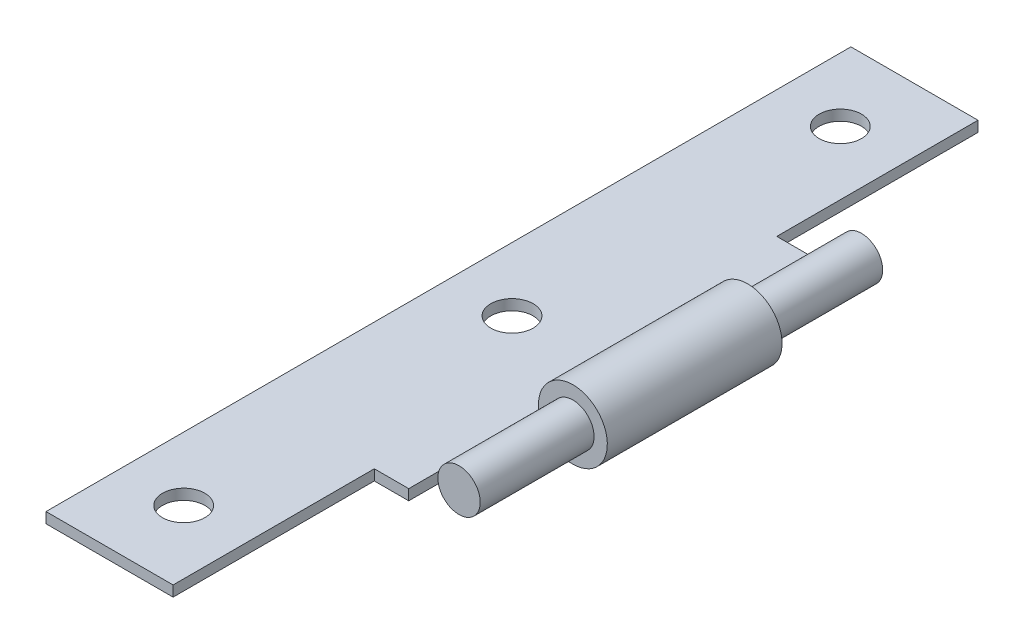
ISO-10303-21;
HEADER;
FILE_DESCRIPTION(('STEP AP214'),'2;1');
FILE_NAME('part.step','',(''),(''),'','','');
FILE_SCHEMA(('AUTOMOTIVE_DESIGN { 1 0 10303 214 1 1 1 1 }'));
ENDSEC;
DATA;
#1=APPLICATION_CONTEXT('core data for automotive mechanical design processes');
#2=APPLICATION_PROTOCOL_DEFINITION('international standard','automotive_design',2000,#1);
#3=PRODUCT_CONTEXT('',#1,'mechanical');
#4=PRODUCT('Part','Part','',(#3));
#5=PRODUCT_RELATED_PRODUCT_CATEGORY('part','',(#4));
#6=PRODUCT_DEFINITION_FORMATION('','',#4);
#7=PRODUCT_DEFINITION_CONTEXT('part definition',#1,'design');
#8=PRODUCT_DEFINITION('design','',#6,#7);
#9=PRODUCT_DEFINITION_SHAPE('','',#8);
#10=(LENGTH_UNIT() NAMED_UNIT(*) SI_UNIT(.MILLI.,.METRE.));
#11=(NAMED_UNIT(*) PLANE_ANGLE_UNIT() SI_UNIT($,.RADIAN.));
#12=(NAMED_UNIT(*) SI_UNIT($,.STERADIAN.) SOLID_ANGLE_UNIT());
#13=UNCERTAINTY_MEASURE_WITH_UNIT(LENGTH_MEASURE(1.E-05),#10,'distance_accuracy_value','');
#14=(GEOMETRIC_REPRESENTATION_CONTEXT(3) GLOBAL_UNCERTAINTY_ASSIGNED_CONTEXT((#13)) GLOBAL_UNIT_ASSIGNED_CONTEXT((#10,
#11,#12)) REPRESENTATION_CONTEXT('',''));
#15=CARTESIAN_POINT('',(0.,0.,0.));
#16=DIRECTION('',(0.,0.,1.));
#17=DIRECTION('',(1.,0.,0.));
#18=AXIS2_PLACEMENT_3D('',#15,#16,#17);
#19=CARTESIAN_POINT('',(-20.,-2.25,58.0249843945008));
#20=DIRECTION('',(0.,-1.,0.));
#21=DIRECTION('',(0.,0.,-1.));
#22=AXIS2_PLACEMENT_3D('',#19,#20,#21);
#23=PLANE('',#22);
#24=CARTESIAN_POINT('',(-14.,-2.25,0.));
#25=DIRECTION('',(0.,1.,0.));
#26=DIRECTION('',(0.,0.,1.));
#27=AXIS2_PLACEMENT_3D('',#24,#25,#26);
#28=CIRCLE('',#27,2.);
#29=CARTESIAN_POINT('',(-14.,-2.25,2.));
#30=VERTEX_POINT('',#29);
#31=EDGE_CURVE('E463',#30,#30,#28,.T.);
#32=ORIENTED_EDGE('',*,*,#31,.F.);
#33=EDGE_LOOP('',(#32));
#34=FACE_BOUND('',#33,.T.);
#35=DIRECTION('',(0.,0.,-1.));
#36=VECTOR('',#35,1.);
#37=CARTESIAN_POINT('',(-4.75000000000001,-2.25,58.0249843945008));
#38=LINE('',#37,#36);
#39=CARTESIAN_POINT('',(-4.75,-2.25,19.));
#40=VERTEX_POINT('',#39);
#41=CARTESIAN_POINT('',(-4.75,-2.25,8.25));
#42=VERTEX_POINT('',#41);
#43=EDGE_CURVE('E159',#40,#42,#38,.T.);
#44=ORIENTED_EDGE('',*,*,#43,.T.);
#45=DIRECTION('',(1.,0.,0.));
#46=VECTOR('',#45,1.);
#47=CARTESIAN_POINT('',(-20.,-2.25,8.25));
#48=LINE('',#47,#46);
#49=CARTESIAN_POINT('',(-2.34520787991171,-2.25,8.25));
#50=VERTEX_POINT('',#49);
#51=EDGE_CURVE('E162',#42,#50,#48,.T.);
#52=ORIENTED_EDGE('',*,*,#51,.T.);
#53=DIRECTION('',(0.,0.,-1.));
#54=VECTOR('',#53,1.);
#55=CARTESIAN_POINT('',(-2.34520787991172,-2.25,38.));
#56=LINE('',#55,#54);
#57=CARTESIAN_POINT('',(-2.34520787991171,-2.25,-8.25));
#58=VERTEX_POINT('',#57);
#59=EDGE_CURVE('E209',#50,#58,#56,.T.);
#60=ORIENTED_EDGE('',*,*,#59,.T.);
#61=DIRECTION('',(-1.,0.,0.));
#62=VECTOR('',#61,1.);
#63=CARTESIAN_POINT('',(-20.,-2.25,-8.25));
#64=LINE('',#63,#62);
#65=CARTESIAN_POINT('',(-4.75,-2.25,-8.25));
#66=VERTEX_POINT('',#65);
#67=EDGE_CURVE('E178',#58,#66,#64,.T.);
#68=ORIENTED_EDGE('',*,*,#67,.T.);
#69=DIRECTION('',(0.,0.,-1.));
#70=VECTOR('',#69,1.);
#71=CARTESIAN_POINT('',(-4.74999999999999,-2.25,58.0249843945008));
#72=LINE('',#71,#70);
#73=CARTESIAN_POINT('',(-4.75,-2.25,-19.));
#74=VERTEX_POINT('',#73);
#75=EDGE_CURVE('E189',#66,#74,#72,.T.);
#76=ORIENTED_EDGE('',*,*,#75,.T.);
#77=DIRECTION('',(-1.,0.,0.));
#78=VECTOR('',#77,1.);
#79=CARTESIAN_POINT('',(-20.,-2.25,-19.));
#80=LINE('',#79,#78);
#81=CARTESIAN_POINT('',(-8.,-2.25,-19.));
#82=VERTEX_POINT('',#81);
#83=EDGE_CURVE('E192',#74,#82,#80,.T.);
#84=ORIENTED_EDGE('',*,*,#83,.T.);
#85=DIRECTION('',(0.,0.,-1.));
#86=VECTOR('',#85,1.);
#87=CARTESIAN_POINT('',(-8.,-2.25,58.0249843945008));
#88=LINE('',#87,#86);
#89=CARTESIAN_POINT('',(-8.,-2.25,-38.));
#90=VERTEX_POINT('',#89);
#91=EDGE_CURVE('E195',#82,#90,#88,.T.);
#92=ORIENTED_EDGE('',*,*,#91,.T.);
#93=DIRECTION('',(1.,0.,0.));
#94=VECTOR('',#93,1.);
#95=CARTESIAN_POINT('',(-20.,-2.25,-38.));
#96=LINE('',#95,#94);
#97=CARTESIAN_POINT('',(-20.,-2.25,-38.));
#98=VERTEX_POINT('',#97);
#99=EDGE_CURVE('E198',#98,#90,#96,.T.);
#100=ORIENTED_EDGE('',*,*,#99,.F.);
#101=DIRECTION('',(0.,0.,-1.));
#102=VECTOR('',#101,1.);
#103=CARTESIAN_POINT('',(-20.,-2.25,58.0249843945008));
#104=LINE('',#103,#102);
#105=CARTESIAN_POINT('',(-20.,-2.25,38.));
#106=VERTEX_POINT('',#105);
#107=EDGE_CURVE('E206',#106,#98,#104,.T.);
#108=ORIENTED_EDGE('',*,*,#107,.F.);
#109=DIRECTION('',(-1.,0.,0.));
#110=VECTOR('',#109,1.);
#111=CARTESIAN_POINT('',(-20.,-2.25,38.));
#112=LINE('',#111,#110);
#113=CARTESIAN_POINT('',(-8.,-2.25,38.));
#114=VERTEX_POINT('',#113);
#115=EDGE_CURVE('E213',#114,#106,#112,.T.);
#116=ORIENTED_EDGE('',*,*,#115,.F.);
#117=DIRECTION('',(0.,0.,-1.));
#118=VECTOR('',#117,1.);
#119=CARTESIAN_POINT('',(-8.,-2.25,58.0249843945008));
#120=LINE('',#119,#118);
#121=CARTESIAN_POINT('',(-8.,-2.25,19.));
#122=VERTEX_POINT('',#121);
#123=EDGE_CURVE('E154',#114,#122,#120,.T.);
#124=ORIENTED_EDGE('',*,*,#123,.T.);
#125=DIRECTION('',(1.,0.,0.));
#126=VECTOR('',#125,1.);
#127=CARTESIAN_POINT('',(-20.,-2.25,19.));
#128=LINE('',#127,#126);
#129=EDGE_CURVE('E131',#122,#40,#128,.T.);
#130=ORIENTED_EDGE('',*,*,#129,.T.);
#131=EDGE_LOOP('',(#44,#52,#60,#68,#76,#84,#92,#100,#108,#116,#124,#130));
#132=FACE_BOUND('',#131,.T.);
#133=CARTESIAN_POINT('',(-14.,-2.25,31.));
#134=DIRECTION('',(0.,1.,0.));
#135=DIRECTION('',(0.,0.,1.));
#136=AXIS2_PLACEMENT_3D('',#133,#134,#135);
#137=CIRCLE('',#136,2.);
#138=CARTESIAN_POINT('',(-14.,-2.25,33.));
#139=VERTEX_POINT('',#138);
#140=EDGE_CURVE('E471',#139,#139,#137,.T.);
#141=ORIENTED_EDGE('',*,*,#140,.F.);
#142=EDGE_LOOP('',(#141));
#143=FACE_BOUND('',#142,.T.);
#144=CARTESIAN_POINT('',(-14.,-2.25,-31.));
#145=DIRECTION('',(0.,1.,0.));
#146=DIRECTION('',(0.,0.,1.));
#147=AXIS2_PLACEMENT_3D('',#144,#145,#146);
#148=CIRCLE('',#147,2.);
#149=CARTESIAN_POINT('',(-14.,-2.25,-29.));
#150=VERTEX_POINT('',#149);
#151=EDGE_CURVE('E460',#150,#150,#148,.T.);
#152=ORIENTED_EDGE('',*,*,#151,.F.);
#153=EDGE_LOOP('',(#152));
#154=FACE_BOUND('',#153,.T.);
#155=ADVANCED_FACE('F33',(#34,#132,#143,#154),#23,.F.);
#156=CARTESIAN_POINT('',(0.,0.,38.));
#157=DIRECTION('',(0.,0.,-1.));
#158=DIRECTION('',(-1.,0.,0.));
#159=AXIS2_PLACEMENT_3D('',#156,#157,#158);
#160=CYLINDRICAL_SURFACE('',#159,3.25);
#161=ORIENTED_EDGE('',*,*,#59,.F.);
#162=CARTESIAN_POINT('',(0.,0.,8.25));
#163=DIRECTION('',(0.,0.,-1.));
#164=DIRECTION('',(-1.,0.,0.));
#165=AXIS2_PLACEMENT_3D('',#162,#163,#164);
#166=CIRCLE('',#165,3.25);
#167=CARTESIAN_POINT('',(0.,-3.25,8.25));
#168=VERTEX_POINT('',#167);
#169=EDGE_CURVE('E165',#50,#168,#166,.T.);
#170=ORIENTED_EDGE('',*,*,#169,.T.);
#171=DIRECTION('',(0.,0.,-1.));
#172=VECTOR('',#171,1.);
#173=CARTESIAN_POINT('',(0.,-3.25,58.0249843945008));
#174=LINE('',#173,#172);
#175=CARTESIAN_POINT('',(0.,-3.25,-8.25));
#176=VERTEX_POINT('',#175);
#177=EDGE_CURVE('E56',#168,#176,#174,.T.);
#178=ORIENTED_EDGE('',*,*,#177,.T.);
#179=CARTESIAN_POINT('',(0.,0.,-8.25));
#180=DIRECTION('',(0.,0.,1.));
#181=DIRECTION('',(1.,0.,0.));
#182=AXIS2_PLACEMENT_3D('',#179,#180,#181);
#183=CIRCLE('',#182,3.25);
#184=EDGE_CURVE('E187',#176,#58,#183,.T.);
#185=ORIENTED_EDGE('',*,*,#184,.T.);
#186=EDGE_LOOP('',(#161,#170,#178,#185));
#187=FACE_BOUND('',#186,.T.);
#188=ADVANCED_FACE('F35',(#187),#160,.T.);
#189=CARTESIAN_POINT('',(0.,0.,38.));
#190=DIRECTION('',(0.,0.,1.));
#191=DIRECTION('',(1.,0.,0.));
#192=AXIS2_PLACEMENT_3D('',#189,#190,#191);
#193=PLANE('',#192);
#194=DIRECTION('',(0.,-1.,0.));
#195=VECTOR('',#194,1.);
#196=CARTESIAN_POINT('',(-8.,3.25,38.));
#197=LINE('',#196,#195);
#198=CARTESIAN_POINT('',(-8.,-3.25,38.));
#199=VERTEX_POINT('',#198);
#200=EDGE_CURVE('E48',#114,#199,#197,.T.);
#201=ORIENTED_EDGE('',*,*,#200,.F.);
#202=ORIENTED_EDGE('',*,*,#115,.T.);
#203=DIRECTION('',(0.,-1.,0.));
#204=VECTOR('',#203,1.);
#205=CARTESIAN_POINT('',(-20.,-2.25,38.));
#206=LINE('',#205,#204);
#207=CARTESIAN_POINT('',(-20.,-3.25,38.));
#208=VERTEX_POINT('',#207);
#209=EDGE_CURVE('E210',#106,#208,#206,.T.);
#210=ORIENTED_EDGE('',*,*,#209,.T.);
#211=DIRECTION('',(1.,0.,0.));
#212=VECTOR('',#211,1.);
#213=CARTESIAN_POINT('',(-20.,-3.25,38.));
#214=LINE('',#213,#212);
#215=EDGE_CURVE('E207',#208,#199,#214,.T.);
#216=ORIENTED_EDGE('',*,*,#215,.T.);
#217=EDGE_LOOP('',(#201,#202,#210,#216));
#218=FACE_BOUND('',#217,.T.);
#219=ADVANCED_FACE('F265',(#218),#193,.T.);
#220=CARTESIAN_POINT('',(0.,0.,-38.));
#221=DIRECTION('',(0.,0.,1.));
#222=DIRECTION('',(1.,0.,0.));
#223=AXIS2_PLACEMENT_3D('',#220,#221,#222);
#224=PLANE('',#223);
#225=ORIENTED_EDGE('',*,*,#99,.T.);
#226=DIRECTION('',(0.,-1.,0.));
#227=VECTOR('',#226,1.);
#228=CARTESIAN_POINT('',(-8.,3.25,-38.));
#229=LINE('',#228,#227);
#230=CARTESIAN_POINT('',(-8.,-3.25,-38.));
#231=VERTEX_POINT('',#230);
#232=EDGE_CURVE('E175',#90,#231,#229,.T.);
#233=ORIENTED_EDGE('',*,*,#232,.T.);
#234=DIRECTION('',(-1.,0.,0.));
#235=VECTOR('',#234,1.);
#236=CARTESIAN_POINT('',(-20.,-3.25,-38.));
#237=LINE('',#236,#235);
#238=CARTESIAN_POINT('',(-20.,-3.25,-38.));
#239=VERTEX_POINT('',#238);
#240=EDGE_CURVE('E204',#231,#239,#237,.T.);
#241=ORIENTED_EDGE('',*,*,#240,.T.);
#242=DIRECTION('',(0.,1.,0.));
#243=VECTOR('',#242,1.);
#244=CARTESIAN_POINT('',(-20.,-2.25,-38.));
#245=LINE('',#244,#243);
#246=EDGE_CURVE('E201',#239,#98,#245,.T.);
#247=ORIENTED_EDGE('',*,*,#246,.T.);
#248=EDGE_LOOP('',(#225,#233,#241,#247));
#249=FACE_BOUND('',#248,.T.);
#250=ADVANCED_FACE('F256',(#249),#224,.F.);
#251=CARTESIAN_POINT('',(-20.,-2.25,58.0249843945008));
#252=DIRECTION('',(1.,0.,0.));
#253=DIRECTION('',(0.,0.,-1.));
#254=AXIS2_PLACEMENT_3D('',#251,#252,#253);
#255=PLANE('',#254);
#256=ORIENTED_EDGE('',*,*,#209,.F.);
#257=ORIENTED_EDGE('',*,*,#107,.T.);
#258=ORIENTED_EDGE('',*,*,#246,.F.);
#259=DIRECTION('',(0.,0.,-1.));
#260=VECTOR('',#259,1.);
#261=CARTESIAN_POINT('',(-20.,-3.25,58.0249843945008));
#262=LINE('',#261,#260);
#263=EDGE_CURVE('E215',#208,#239,#262,.T.);
#264=ORIENTED_EDGE('',*,*,#263,.F.);
#265=EDGE_LOOP('',(#256,#257,#258,#264));
#266=FACE_BOUND('',#265,.T.);
#267=ADVANCED_FACE('F262',(#266),#255,.F.);
#268=CARTESIAN_POINT('',(-20.,-3.25,58.0249843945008));
#269=DIRECTION('',(0.,1.,0.));
#270=DIRECTION('',(0.,0.,1.));
#271=AXIS2_PLACEMENT_3D('',#268,#269,#270);
#272=PLANE('',#271);
#273=CARTESIAN_POINT('',(-14.,-3.25,-31.));
#274=DIRECTION('',(0.,1.,0.));
#275=DIRECTION('',(0.,0.,1.));
#276=AXIS2_PLACEMENT_3D('',#273,#274,#275);
#277=CIRCLE('',#276,2.);
#278=CARTESIAN_POINT('',(-14.,-3.25,-29.));
#279=VERTEX_POINT('',#278);
#280=EDGE_CURVE('E457',#279,#279,#277,.T.);
#281=ORIENTED_EDGE('',*,*,#280,.T.);
#282=EDGE_LOOP('',(#281));
#283=FACE_BOUND('',#282,.T.);
#284=CARTESIAN_POINT('',(-14.,-3.25,0.));
#285=DIRECTION('',(0.,1.,0.));
#286=DIRECTION('',(0.,0.,1.));
#287=AXIS2_PLACEMENT_3D('',#284,#285,#286);
#288=CIRCLE('',#287,2.);
#289=CARTESIAN_POINT('',(-14.,-3.25,2.));
#290=VERTEX_POINT('',#289);
#291=EDGE_CURVE('E468',#290,#290,#288,.T.);
#292=ORIENTED_EDGE('',*,*,#291,.T.);
#293=EDGE_LOOP('',(#292));
#294=FACE_BOUND('',#293,.T.);
#295=CARTESIAN_POINT('',(-14.,-3.25,31.));
#296=DIRECTION('',(0.,1.,0.));
#297=DIRECTION('',(0.,0.,1.));
#298=AXIS2_PLACEMENT_3D('',#295,#296,#297);
#299=CIRCLE('',#298,2.);
#300=CARTESIAN_POINT('',(-14.,-3.25,33.));
#301=VERTEX_POINT('',#300);
#302=EDGE_CURVE('E474',#301,#301,#299,.T.);
#303=ORIENTED_EDGE('',*,*,#302,.T.);
#304=EDGE_LOOP('',(#303));
#305=FACE_BOUND('',#304,.T.);
#306=ORIENTED_EDGE('',*,*,#177,.F.);
#307=DIRECTION('',(1.,0.,0.));
#308=VECTOR('',#307,1.);
#309=CARTESIAN_POINT('',(-4.75,-3.25,8.25));
#310=LINE('',#309,#308);
#311=CARTESIAN_POINT('',(-4.75,-3.25,8.25));
#312=VERTEX_POINT('',#311);
#313=EDGE_CURVE('E146',#312,#168,#310,.T.);
#314=ORIENTED_EDGE('',*,*,#313,.F.);
#315=DIRECTION('',(0.,0.,-1.));
#316=VECTOR('',#315,1.);
#317=CARTESIAN_POINT('',(-4.75,-3.25,8.25));
#318=LINE('',#317,#316);
#319=CARTESIAN_POINT('',(-4.75,-3.25,19.));
#320=VERTEX_POINT('',#319);
#321=EDGE_CURVE('E144',#320,#312,#318,.T.);
#322=ORIENTED_EDGE('',*,*,#321,.F.);
#323=DIRECTION('',(1.,0.,0.));
#324=VECTOR('',#323,1.);
#325=CARTESIAN_POINT('',(-8.,-3.25,19.));
#326=LINE('',#325,#324);
#327=CARTESIAN_POINT('',(-8.,-3.25,19.));
#328=VERTEX_POINT('',#327);
#329=EDGE_CURVE('E128',#328,#320,#326,.T.);
#330=ORIENTED_EDGE('',*,*,#329,.F.);
#331=DIRECTION('',(0.,0.,-1.));
#332=VECTOR('',#331,1.);
#333=CARTESIAN_POINT('',(-8.,-3.25,19.));
#334=LINE('',#333,#332);
#335=EDGE_CURVE('E135',#199,#328,#334,.T.);
#336=ORIENTED_EDGE('',*,*,#335,.F.);
#337=ORIENTED_EDGE('',*,*,#215,.F.);
#338=ORIENTED_EDGE('',*,*,#263,.T.);
#339=ORIENTED_EDGE('',*,*,#240,.F.);
#340=DIRECTION('',(0.,0.,-1.));
#341=VECTOR('',#340,1.);
#342=CARTESIAN_POINT('',(-8.,-3.25,-38.));
#343=LINE('',#342,#341);
#344=CARTESIAN_POINT('',(-8.,-3.25,-19.));
#345=VERTEX_POINT('',#344);
#346=EDGE_CURVE('E167',#345,#231,#343,.T.);
#347=ORIENTED_EDGE('',*,*,#346,.F.);
#348=DIRECTION('',(-1.,0.,0.));
#349=VECTOR('',#348,1.);
#350=CARTESIAN_POINT('',(-4.75,-3.25,-19.));
#351=LINE('',#350,#349);
#352=CARTESIAN_POINT('',(-4.75,-3.25,-19.));
#353=VERTEX_POINT('',#352);
#354=EDGE_CURVE('E172',#353,#345,#351,.T.);
#355=ORIENTED_EDGE('',*,*,#354,.F.);
#356=DIRECTION('',(0.,0.,-1.));
#357=VECTOR('',#356,1.);
#358=CARTESIAN_POINT('',(-4.75,-3.25,-8.25));
#359=LINE('',#358,#357);
#360=CARTESIAN_POINT('',(-4.75,-3.25,-8.25));
#361=VERTEX_POINT('',#360);
#362=EDGE_CURVE('E169',#361,#353,#359,.T.);
#363=ORIENTED_EDGE('',*,*,#362,.F.);
#364=DIRECTION('',(1.,0.,0.));
#365=VECTOR('',#364,1.);
#366=CARTESIAN_POINT('',(-20.,-3.25,-8.25));
#367=LINE('',#366,#365);
#368=EDGE_CURVE('E221',#361,#176,#367,.T.);
#369=ORIENTED_EDGE('',*,*,#368,.T.);
#370=EDGE_LOOP('',(#306,#314,#322,#330,#336,#337,#338,#339,#347,#355,#363,#369));
#371=FACE_BOUND('',#370,.T.);
#372=ADVANCED_FACE('F141',(#283,#294,#305,#371),#272,.F.);
#373=CARTESIAN_POINT('',(-8.,3.25,-38.));
#374=DIRECTION('',(-1.,0.,0.));
#375=DIRECTION('',(0.,0.,1.));
#376=AXIS2_PLACEMENT_3D('',#373,#374,#375);
#377=PLANE('',#376);
#378=DIRECTION('',(0.,-1.,0.));
#379=VECTOR('',#378,1.);
#380=CARTESIAN_POINT('',(-8.,3.25,-19.));
#381=LINE('',#380,#379);
#382=EDGE_CURVE('E176',#82,#345,#381,.T.);
#383=ORIENTED_EDGE('',*,*,#382,.T.);
#384=ORIENTED_EDGE('',*,*,#346,.T.);
#385=ORIENTED_EDGE('',*,*,#232,.F.);
#386=ORIENTED_EDGE('',*,*,#91,.F.);
#387=EDGE_LOOP('',(#383,#384,#385,#386));
#388=FACE_BOUND('',#387,.T.);
#389=ADVANCED_FACE('F252',(#388),#377,.F.);
#390=CARTESIAN_POINT('',(-4.75,3.25,-19.));
#391=DIRECTION('',(0.,0.,1.));
#392=DIRECTION('',(1.,0.,0.));
#393=AXIS2_PLACEMENT_3D('',#390,#391,#392);
#394=PLANE('',#393);
#395=DIRECTION('',(0.,-1.,0.));
#396=VECTOR('',#395,1.);
#397=CARTESIAN_POINT('',(-4.75,3.25,-19.));
#398=LINE('',#397,#396);
#399=EDGE_CURVE('E179',#74,#353,#398,.T.);
#400=ORIENTED_EDGE('',*,*,#399,.T.);
#401=ORIENTED_EDGE('',*,*,#354,.T.);
#402=ORIENTED_EDGE('',*,*,#382,.F.);
#403=ORIENTED_EDGE('',*,*,#83,.F.);
#404=EDGE_LOOP('',(#400,#401,#402,#403));
#405=FACE_BOUND('',#404,.T.);
#406=ADVANCED_FACE('F248',(#405),#394,.F.);
#407=CARTESIAN_POINT('',(-4.75,3.25,-8.25));
#408=DIRECTION('',(-1.,0.,0.));
#409=DIRECTION('',(0.,0.,1.));
#410=AXIS2_PLACEMENT_3D('',#407,#408,#409);
#411=PLANE('',#410);
#412=DIRECTION('',(0.,-1.,0.));
#413=VECTOR('',#412,1.);
#414=CARTESIAN_POINT('',(-4.75,3.25,-8.25));
#415=LINE('',#414,#413);
#416=EDGE_CURVE('E181',#66,#361,#415,.T.);
#417=ORIENTED_EDGE('',*,*,#416,.T.);
#418=ORIENTED_EDGE('',*,*,#362,.T.);
#419=ORIENTED_EDGE('',*,*,#399,.F.);
#420=ORIENTED_EDGE('',*,*,#75,.F.);
#421=EDGE_LOOP('',(#417,#418,#419,#420));
#422=FACE_BOUND('',#421,.T.);
#423=ADVANCED_FACE('F244',(#422),#411,.F.);
#424=CARTESIAN_POINT('',(-4.75,3.25,-8.25));
#425=DIRECTION('',(0.,0.,1.));
#426=DIRECTION('',(1.,0.,0.));
#427=AXIS2_PLACEMENT_3D('',#424,#425,#426);
#428=PLANE('',#427);
#429=CARTESIAN_POINT('',(0.,0.,-8.25));
#430=DIRECTION('',(0.,0.,1.));
#431=DIRECTION('',(1.,0.,0.));
#432=AXIS2_PLACEMENT_3D('',#429,#430,#431);
#433=CIRCLE('',#432,2.);
#434=CARTESIAN_POINT('',(2.,0.,-8.25));
#435=VERTEX_POINT('',#434);
#436=EDGE_CURVE('E11',#435,#435,#433,.F.);
#437=ORIENTED_EDGE('',*,*,#436,.F.);
#438=EDGE_LOOP('',(#437));
#439=FACE_BOUND('',#438,.T.);
#440=ORIENTED_EDGE('',*,*,#368,.F.);
#441=ORIENTED_EDGE('',*,*,#416,.F.);
#442=ORIENTED_EDGE('',*,*,#67,.F.);
#443=ORIENTED_EDGE('',*,*,#184,.F.);
#444=EDGE_LOOP('',(#440,#441,#442,#443));
#445=FACE_BOUND('',#444,.T.);
#446=ADVANCED_FACE('F232',(#439,#445),#428,.F.);
#447=CARTESIAN_POINT('',(-4.75,3.25,8.25));
#448=DIRECTION('',(0.,0.,-1.));
#449=DIRECTION('',(-1.,0.,0.));
#450=AXIS2_PLACEMENT_3D('',#447,#448,#449);
#451=PLANE('',#450);
#452=CARTESIAN_POINT('',(0.,0.,8.25));
#453=DIRECTION('',(0.,0.,-1.));
#454=DIRECTION('',(-1.,0.,0.));
#455=AXIS2_PLACEMENT_3D('',#452,#453,#454);
#456=CIRCLE('',#455,2.);
#457=CARTESIAN_POINT('',(-2.,0.,8.25));
#458=VERTEX_POINT('',#457);
#459=EDGE_CURVE('E41',#458,#458,#456,.F.);
#460=ORIENTED_EDGE('',*,*,#459,.F.);
#461=EDGE_LOOP('',(#460));
#462=FACE_BOUND('',#461,.T.);
#463=ORIENTED_EDGE('',*,*,#169,.F.);
#464=ORIENTED_EDGE('',*,*,#51,.F.);
#465=DIRECTION('',(0.,-1.,0.));
#466=VECTOR('',#465,1.);
#467=CARTESIAN_POINT('',(-4.75,3.25,8.25));
#468=LINE('',#467,#466);
#469=EDGE_CURVE('E152',#42,#312,#468,.T.);
#470=ORIENTED_EDGE('',*,*,#469,.T.);
#471=ORIENTED_EDGE('',*,*,#313,.T.);
#472=EDGE_LOOP('',(#463,#464,#470,#471));
#473=FACE_BOUND('',#472,.T.);
#474=ADVANCED_FACE('F228',(#462,#473),#451,.F.);
#475=CARTESIAN_POINT('',(-4.75,3.25,8.25));
#476=DIRECTION('',(-1.,0.,0.));
#477=DIRECTION('',(0.,0.,1.));
#478=AXIS2_PLACEMENT_3D('',#475,#476,#477);
#479=PLANE('',#478);
#480=DIRECTION('',(0.,-1.,0.));
#481=VECTOR('',#480,1.);
#482=CARTESIAN_POINT('',(-4.75,3.25,19.));
#483=LINE('',#482,#481);
#484=EDGE_CURVE('E133',#40,#320,#483,.T.);
#485=ORIENTED_EDGE('',*,*,#484,.T.);
#486=ORIENTED_EDGE('',*,*,#321,.T.);
#487=ORIENTED_EDGE('',*,*,#469,.F.);
#488=ORIENTED_EDGE('',*,*,#43,.F.);
#489=EDGE_LOOP('',(#485,#486,#487,#488));
#490=FACE_BOUND('',#489,.T.);
#491=ADVANCED_FACE('F231',(#490),#479,.F.);
#492=CARTESIAN_POINT('',(-8.,3.25,19.));
#493=DIRECTION('',(0.,0.,-1.));
#494=DIRECTION('',(-1.,0.,0.));
#495=AXIS2_PLACEMENT_3D('',#492,#493,#494);
#496=PLANE('',#495);
#497=DIRECTION('',(0.,-1.,0.));
#498=VECTOR('',#497,1.);
#499=CARTESIAN_POINT('',(-8.,3.25,19.));
#500=LINE('',#499,#498);
#501=EDGE_CURVE('E124',#122,#328,#500,.T.);
#502=ORIENTED_EDGE('',*,*,#501,.T.);
#503=ORIENTED_EDGE('',*,*,#329,.T.);
#504=ORIENTED_EDGE('',*,*,#484,.F.);
#505=ORIENTED_EDGE('',*,*,#129,.F.);
#506=EDGE_LOOP('',(#502,#503,#504,#505));
#507=FACE_BOUND('',#506,.T.);
#508=ADVANCED_FACE('F125',(#507),#496,.F.);
#509=CARTESIAN_POINT('',(-8.,3.25,19.));
#510=DIRECTION('',(-1.,0.,0.));
#511=DIRECTION('',(0.,0.,1.));
#512=AXIS2_PLACEMENT_3D('',#509,#510,#511);
#513=PLANE('',#512);
#514=ORIENTED_EDGE('',*,*,#200,.T.);
#515=ORIENTED_EDGE('',*,*,#335,.T.);
#516=ORIENTED_EDGE('',*,*,#501,.F.);
#517=ORIENTED_EDGE('',*,*,#123,.F.);
#518=EDGE_LOOP('',(#514,#515,#516,#517));
#519=FACE_BOUND('',#518,.T.);
#520=ADVANCED_FACE('F136',(#519),#513,.F.);
#521=CARTESIAN_POINT('',(0.,0.,24.6568542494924));
#522=DIRECTION('',(0.,0.,-1.));
#523=DIRECTION('',(-1.,0.,0.));
#524=AXIS2_PLACEMENT_3D('',#521,#522,#523);
#525=CYLINDRICAL_SURFACE('',#524,2.);
#526=CARTESIAN_POINT('',(0.,0.,19.));
#527=DIRECTION('',(0.,0.,-1.));
#528=DIRECTION('',(-1.,0.,0.));
#529=AXIS2_PLACEMENT_3D('',#526,#527,#528);
#530=CIRCLE('',#529,2.);
#531=CARTESIAN_POINT('',(-2.,0.,19.));
#532=VERTEX_POINT('',#531);
#533=EDGE_CURVE('E139',#532,#532,#530,.T.);
#534=ORIENTED_EDGE('',*,*,#533,.T.);
#535=EDGE_LOOP('',(#534));
#536=FACE_BOUND('',#535,.T.);
#537=ORIENTED_EDGE('',*,*,#459,.T.);
#538=EDGE_LOOP('',(#537));
#539=FACE_BOUND('',#538,.T.);
#540=ADVANCED_FACE('F226',(#536,#539),#525,.T.);
#541=CARTESIAN_POINT('',(-8.,3.25,19.));
#542=DIRECTION('',(0.,0.,-1.));
#543=DIRECTION('',(-1.,0.,0.));
#544=AXIS2_PLACEMENT_3D('',#541,#542,#543);
#545=PLANE('',#544);
#546=ORIENTED_EDGE('',*,*,#533,.F.);
#547=EDGE_LOOP('',(#546));
#548=FACE_BOUND('',#547,.T.);
#549=ADVANCED_FACE('F349',(#548),#545,.F.);
#550=CARTESIAN_POINT('',(0.,0.,-24.6568542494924));
#551=DIRECTION('',(0.,0.,1.));
#552=DIRECTION('',(-1.,0.,0.));
#553=AXIS2_PLACEMENT_3D('',#550,#551,#552);
#554=CYLINDRICAL_SURFACE('',#553,2.);
#555=CARTESIAN_POINT('',(0.,0.,-19.));
#556=DIRECTION('',(0.,0.,-1.));
#557=DIRECTION('',(-1.,0.,0.));
#558=AXIS2_PLACEMENT_3D('',#555,#556,#557);
#559=CIRCLE('',#558,2.);
#560=CARTESIAN_POINT('',(-2.,0.,-19.));
#561=VERTEX_POINT('',#560);
#562=EDGE_CURVE('E477',#561,#561,#559,.T.);
#563=ORIENTED_EDGE('',*,*,#562,.F.);
#564=EDGE_LOOP('',(#563));
#565=FACE_BOUND('',#564,.T.);
#566=ORIENTED_EDGE('',*,*,#436,.T.);
#567=EDGE_LOOP('',(#566));
#568=FACE_BOUND('',#567,.T.);
#569=ADVANCED_FACE('F356',(#565,#568),#554,.T.);
#570=CARTESIAN_POINT('',(-8.,3.25,-19.));
#571=DIRECTION('',(0.,0.,1.));
#572=DIRECTION('',(-1.,0.,0.));
#573=AXIS2_PLACEMENT_3D('',#570,#571,#572);
#574=PLANE('',#573);
#575=ORIENTED_EDGE('',*,*,#562,.T.);
#576=EDGE_LOOP('',(#575));
#577=FACE_BOUND('',#576,.T.);
#578=ADVANCED_FACE('F363',(#577),#574,.F.);
#579=CARTESIAN_POINT('',(-14.,-2.25,31.));
#580=DIRECTION('',(0.,1.,0.));
#581=DIRECTION('',(0.,0.,1.));
#582=AXIS2_PLACEMENT_3D('',#579,#580,#581);
#583=CYLINDRICAL_SURFACE('',#582,2.);
#584=ORIENTED_EDGE('',*,*,#302,.F.);
#585=EDGE_LOOP('',(#584));
#586=FACE_BOUND('',#585,.T.);
#587=ORIENTED_EDGE('',*,*,#140,.T.);
#588=EDGE_LOOP('',(#587));
#589=FACE_BOUND('',#588,.T.);
#590=ADVANCED_FACE('F371',(#586,#589),#583,.F.);
#591=CARTESIAN_POINT('',(-14.,-2.25,0.));
#592=DIRECTION('',(0.,1.,0.));
#593=DIRECTION('',(0.,0.,1.));
#594=AXIS2_PLACEMENT_3D('',#591,#592,#593);
#595=CYLINDRICAL_SURFACE('',#594,2.);
#596=ORIENTED_EDGE('',*,*,#291,.F.);
#597=EDGE_LOOP('',(#596));
#598=FACE_BOUND('',#597,.T.);
#599=ORIENTED_EDGE('',*,*,#31,.T.);
#600=EDGE_LOOP('',(#599));
#601=FACE_BOUND('',#600,.T.);
#602=ADVANCED_FACE('F378',(#598,#601),#595,.F.);
#603=CARTESIAN_POINT('',(-14.,-2.25,-31.));
#604=DIRECTION('',(0.,1.,0.));
#605=DIRECTION('',(0.,0.,1.));
#606=AXIS2_PLACEMENT_3D('',#603,#604,#605);
#607=CYLINDRICAL_SURFACE('',#606,2.);
#608=ORIENTED_EDGE('',*,*,#280,.F.);
#609=EDGE_LOOP('',(#608));
#610=FACE_BOUND('',#609,.T.);
#611=ORIENTED_EDGE('',*,*,#151,.T.);
#612=EDGE_LOOP('',(#611));
#613=FACE_BOUND('',#612,.T.);
#614=ADVANCED_FACE('F386',(#610,#613),#607,.F.);
#615=CLOSED_SHELL('',(#155,#188,#219,#250,#267,#372,#389,#406,#423,#446,#474,#491,#508,#520,
#540,#549,#569,#578,#590,#602,#614));
#616=MANIFOLD_SOLID_BREP('B2',#615);
#617=ADVANCED_BREP_SHAPE_REPRESENTATION('',(#18,#616),#14);
#618=SHAPE_DEFINITION_REPRESENTATION(#9,#617);
ENDSEC;
END-ISO-10303-21;
